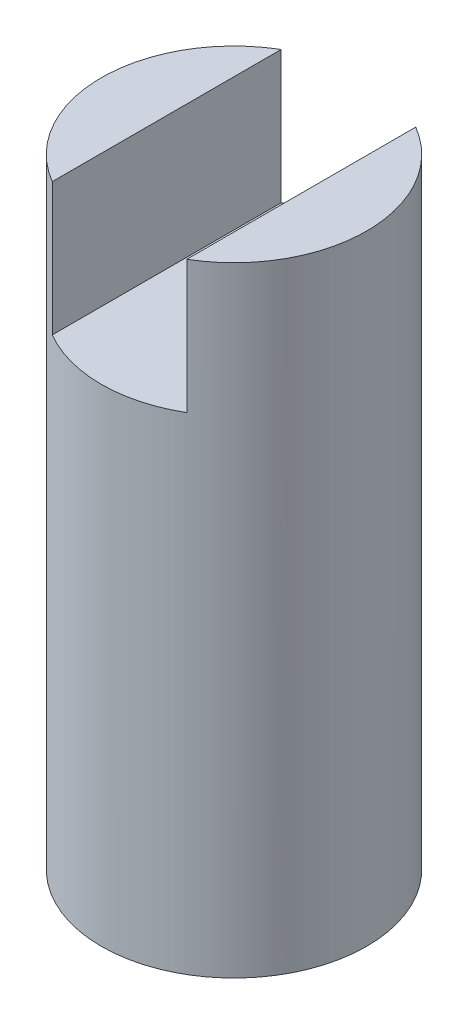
from build123d import *

# Parameters (mm, degrees)
ESQUISSE1_R               = 15
EXTRUSION1_DEPTH          = 70
TROU_TARAUD_M6X1_01_D     = 5
TROU_TARAUD_M6X1_01_DEPTH = 15
TROU_TARAUD_M6X1_01_TIP   = 1.502151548
ESQUISSE4_W               = 50
ESQUISSE4_H               = 30
ENL_V_MAT_EXTRU_1_DEPTH   = 7.6


with BuildPart() as part:
    # Esquisse1 → Extrusion1 (new body)
    with BuildSketch(Plane(origin=(0, 0, 0), x_dir=(1, 0, 0), z_dir=(0, 1, 0))):
        with Locations(Location((0, 0, 0), (0, 0, 270))):
            Circle(ESQUISSE1_R)
    extrude(amount=EXTRUSION1_DEPTH)

    # Trou taraud_ M6x1.01
    with Locations(Plane.XZ):
        with Locations((0, 0)):
            Hole(TROU_TARAUD_M6X1_01_D / 2, depth=TROU_TARAUD_M6X1_01_DEPTH)
            with Locations((0, 0, -(TROU_TARAUD_M6X1_01_DEPTH + TROU_TARAUD_M6X1_01_TIP / 2))):  # 118° drill point
                Cone(0, TROU_TARAUD_M6X1_01_D / 2, TROU_TARAUD_M6X1_01_TIP, mode=Mode.SUBTRACT)

    # Esquisse4 → Enl_v. mat.-Extru.1 (cut, symmetric)
    with BuildSketch(Plane(origin=(0, 0, 0), x_dir=(0, 0, -1), z_dir=(1, 0, 0))):
        with Locations((0, 70)):
            Rectangle(ESQUISSE4_W, ESQUISSE4_H)
    extrude(amount=ENL_V_MAT_EXTRU_1_DEPTH, both=True, mode=Mode.SUBTRACT)


solid = part.part
